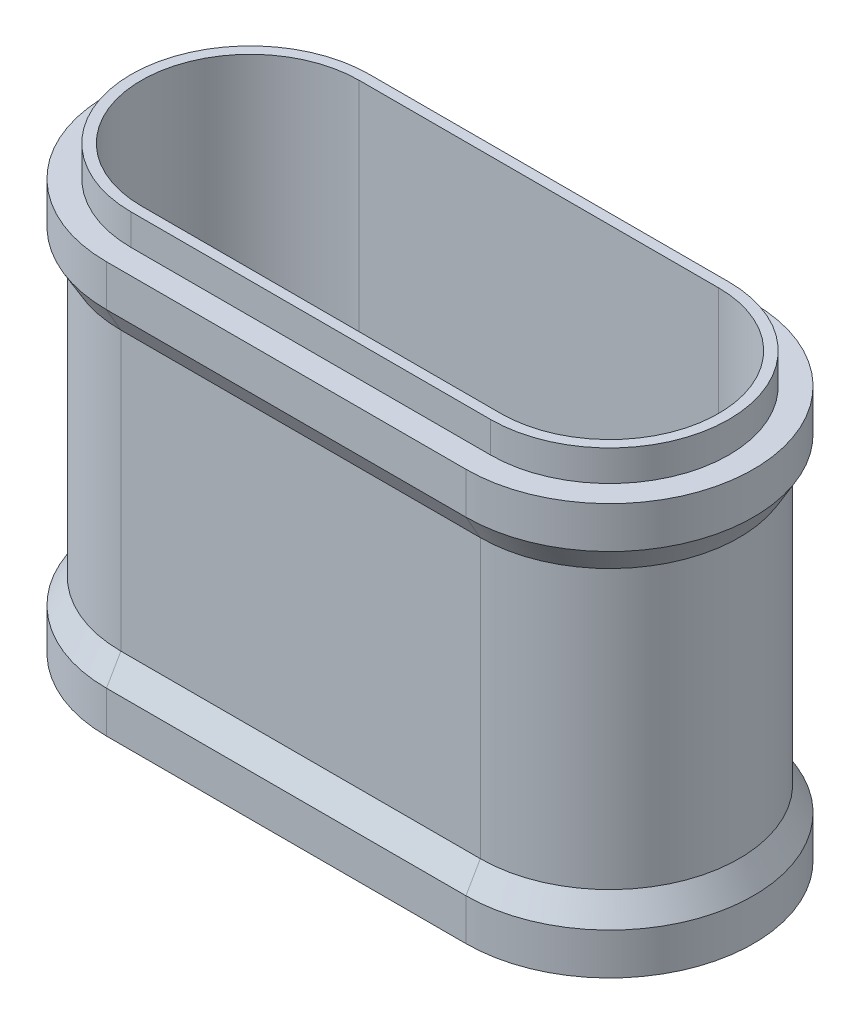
ISO-10303-21;
HEADER;
FILE_DESCRIPTION(('STEP AP214'),'2;1');
FILE_NAME('part.step','',(''),(''),'','','');
FILE_SCHEMA(('AUTOMOTIVE_DESIGN { 1 0 10303 214 1 1 1 1 }'));
ENDSEC;
DATA;
#1=APPLICATION_CONTEXT('core data for automotive mechanical design processes');
#2=APPLICATION_PROTOCOL_DEFINITION('international standard','automotive_design',2000,#1);
#3=PRODUCT_CONTEXT('',#1,'mechanical');
#4=PRODUCT('Part','Part','',(#3));
#5=PRODUCT_RELATED_PRODUCT_CATEGORY('part','',(#4));
#6=PRODUCT_DEFINITION_FORMATION('','',#4);
#7=PRODUCT_DEFINITION_CONTEXT('part definition',#1,'design');
#8=PRODUCT_DEFINITION('design','',#6,#7);
#9=PRODUCT_DEFINITION_SHAPE('','',#8);
#10=(LENGTH_UNIT() NAMED_UNIT(*) SI_UNIT(.MILLI.,.METRE.));
#11=(NAMED_UNIT(*) PLANE_ANGLE_UNIT() SI_UNIT($,.RADIAN.));
#12=(NAMED_UNIT(*) SI_UNIT($,.STERADIAN.) SOLID_ANGLE_UNIT());
#13=UNCERTAINTY_MEASURE_WITH_UNIT(LENGTH_MEASURE(1.E-05),#10,'distance_accuracy_value','');
#14=(GEOMETRIC_REPRESENTATION_CONTEXT(3) GLOBAL_UNCERTAINTY_ASSIGNED_CONTEXT((#13)) GLOBAL_UNIT_ASSIGNED_CONTEXT((#10,
#11,#12)) REPRESENTATION_CONTEXT('',''));
#15=CARTESIAN_POINT('',(0.,0.,0.));
#16=DIRECTION('',(0.,0.,1.));
#17=DIRECTION('',(1.,0.,0.));
#18=AXIS2_PLACEMENT_3D('',#15,#16,#17);
#19=CARTESIAN_POINT('',(-8.75,10.,0.));
#20=DIRECTION('',(0.,1.,0.));
#21=DIRECTION('',(0.,0.,1.));
#22=AXIS2_PLACEMENT_3D('',#19,#20,#21);
#23=PLANE('',#22);
#24=CARTESIAN_POINT('',(8.75,10.,0.));
#25=DIRECTION('',(0.,1.,0.));
#26=DIRECTION('',(0.,0.,1.));
#27=AXIS2_PLACEMENT_3D('',#24,#25,#26);
#28=CIRCLE('',#27,7.);
#29=CARTESIAN_POINT('',(8.75,10.,7.));
#30=VERTEX_POINT('',#29);
#31=CARTESIAN_POINT('',(8.75,10.,-7.));
#32=VERTEX_POINT('',#31);
#33=EDGE_CURVE('E280',#30,#32,#28,.T.);
#34=ORIENTED_EDGE('',*,*,#33,.T.);
#35=DIRECTION('',(-1.,0.,0.));
#36=VECTOR('',#35,1.);
#37=CARTESIAN_POINT('',(8.75,10.,-7.));
#38=LINE('',#37,#36);
#39=CARTESIAN_POINT('',(-8.75,10.,-7.));
#40=VERTEX_POINT('',#39);
#41=EDGE_CURVE('E295',#32,#40,#38,.T.);
#42=ORIENTED_EDGE('',*,*,#41,.T.);
#43=CARTESIAN_POINT('',(-8.75,10.,0.));
#44=DIRECTION('',(0.,1.,0.));
#45=DIRECTION('',(0.,0.,1.));
#46=AXIS2_PLACEMENT_3D('',#43,#44,#45);
#47=CIRCLE('',#46,7.);
#48=CARTESIAN_POINT('',(-8.75,10.,7.));
#49=VERTEX_POINT('',#48);
#50=EDGE_CURVE('E299',#40,#49,#47,.T.);
#51=ORIENTED_EDGE('',*,*,#50,.T.);
#52=DIRECTION('',(1.,0.,0.));
#53=VECTOR('',#52,1.);
#54=CARTESIAN_POINT('',(8.75,10.,7.));
#55=LINE('',#54,#53);
#56=EDGE_CURVE('E303',#49,#30,#55,.T.);
#57=ORIENTED_EDGE('',*,*,#56,.T.);
#58=EDGE_LOOP('',(#34,#42,#51,#57));
#59=FACE_BOUND('',#58,.T.);
#60=DIRECTION('',(1.,0.,0.));
#61=VECTOR('',#60,1.);
#62=CARTESIAN_POINT('',(-8.75,10.,5.8));
#63=LINE('',#62,#61);
#64=CARTESIAN_POINT('',(-8.75,10.,5.8));
#65=VERTEX_POINT('',#64);
#66=CARTESIAN_POINT('',(8.75,10.,5.8));
#67=VERTEX_POINT('',#66);
#68=EDGE_CURVE('E240',#65,#67,#63,.T.);
#69=ORIENTED_EDGE('',*,*,#68,.F.);
#70=CARTESIAN_POINT('',(-8.75,10.,0.));
#71=DIRECTION('',(0.,1.,0.));
#72=DIRECTION('',(0.,0.,1.));
#73=AXIS2_PLACEMENT_3D('',#70,#71,#72);
#74=CIRCLE('',#73,5.8);
#75=CARTESIAN_POINT('',(-8.75,10.,-5.8));
#76=VERTEX_POINT('',#75);
#77=EDGE_CURVE('E221',#76,#65,#74,.T.);
#78=ORIENTED_EDGE('',*,*,#77,.F.);
#79=DIRECTION('',(-1.,0.,0.));
#80=VECTOR('',#79,1.);
#81=CARTESIAN_POINT('',(8.74999999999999,10.,-5.8));
#82=LINE('',#81,#80);
#83=CARTESIAN_POINT('',(8.74999999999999,10.,-5.8));
#84=VERTEX_POINT('',#83);
#85=EDGE_CURVE('E227',#84,#76,#82,.T.);
#86=ORIENTED_EDGE('',*,*,#85,.F.);
#87=CARTESIAN_POINT('',(8.75,10.,0.));
#88=DIRECTION('',(0.,1.,0.));
#89=DIRECTION('',(0.,0.,1.));
#90=AXIS2_PLACEMENT_3D('',#87,#88,#89);
#91=CIRCLE('',#90,5.8);
#92=EDGE_CURVE('E243',#67,#84,#91,.T.);
#93=ORIENTED_EDGE('',*,*,#92,.F.);
#94=EDGE_LOOP('',(#69,#78,#86,#93));
#95=FACE_BOUND('',#94,.T.);
#96=ADVANCED_FACE('F45',(#59,#95),#23,.T.);
#97=CARTESIAN_POINT('',(-8.75,-10.,0.));
#98=DIRECTION('',(0.,1.,0.));
#99=DIRECTION('',(0.,0.,1.));
#100=AXIS2_PLACEMENT_3D('',#97,#98,#99);
#101=CYLINDRICAL_SURFACE('',#100,6.3);
#102=DIRECTION('',(0.,1.,0.));
#103=VECTOR('',#102,1.);
#104=CARTESIAN_POINT('',(-8.75,-10.,-6.3));
#105=LINE('',#104,#103);
#106=CARTESIAN_POINT('',(-8.75,-6.76794919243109,-6.3));
#107=VERTEX_POINT('',#106);
#108=CARTESIAN_POINT('',(-8.75,6.76794919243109,-6.3));
#109=VERTEX_POINT('',#108);
#110=EDGE_CURVE('E338',#107,#109,#105,.T.);
#111=ORIENTED_EDGE('',*,*,#110,.F.);
#112=CARTESIAN_POINT('',(-8.75,-6.76794919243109,0.));
#113=DIRECTION('',(0.,-1.,0.));
#114=DIRECTION('',(0.,0.,-1.));
#115=AXIS2_PLACEMENT_3D('',#112,#113,#114);
#116=CIRCLE('',#115,6.3);
#117=CARTESIAN_POINT('',(-8.75,-6.76794919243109,6.3));
#118=VERTEX_POINT('',#117);
#119=EDGE_CURVE('E376',#107,#118,#116,.F.);
#120=ORIENTED_EDGE('',*,*,#119,.T.);
#121=DIRECTION('',(0.,1.,0.));
#122=VECTOR('',#121,1.);
#123=CARTESIAN_POINT('',(-8.75,-10.,6.3));
#124=LINE('',#123,#122);
#125=CARTESIAN_POINT('',(-8.75,6.76794919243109,6.3));
#126=VERTEX_POINT('',#125);
#127=EDGE_CURVE('E332',#118,#126,#124,.T.);
#128=ORIENTED_EDGE('',*,*,#127,.T.);
#129=CARTESIAN_POINT('',(-8.75,6.76794919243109,0.));
#130=DIRECTION('',(0.,1.,0.));
#131=DIRECTION('',(0.,0.,1.));
#132=AXIS2_PLACEMENT_3D('',#129,#130,#131);
#133=CIRCLE('',#132,6.3);
#134=EDGE_CURVE('E373',#126,#109,#133,.F.);
#135=ORIENTED_EDGE('',*,*,#134,.T.);
#136=EDGE_LOOP('',(#111,#120,#128,#135));
#137=FACE_BOUND('',#136,.T.);
#138=ADVANCED_FACE('F477',(#137),#101,.T.);
#139=CARTESIAN_POINT('',(-8.75,-10.,-6.3));
#140=DIRECTION('',(0.,0.,-1.));
#141=DIRECTION('',(-1.,0.,0.));
#142=AXIS2_PLACEMENT_3D('',#139,#140,#141);
#143=PLANE('',#142);
#144=DIRECTION('',(0.,1.,0.));
#145=VECTOR('',#144,1.);
#146=CARTESIAN_POINT('',(8.75,-10.,-6.3));
#147=LINE('',#146,#145);
#148=CARTESIAN_POINT('',(8.75,-6.76794919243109,-6.3));
#149=VERTEX_POINT('',#148);
#150=CARTESIAN_POINT('',(8.75,6.76794919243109,-6.3));
#151=VERTEX_POINT('',#150);
#152=EDGE_CURVE('E343',#149,#151,#147,.T.);
#153=ORIENTED_EDGE('',*,*,#152,.F.);
#154=DIRECTION('',(-1.,0.,0.));
#155=VECTOR('',#154,1.);
#156=CARTESIAN_POINT('',(-8.75,-6.76794919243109,-6.3));
#157=LINE('',#156,#155);
#158=EDGE_CURVE('E364',#149,#107,#157,.T.);
#159=ORIENTED_EDGE('',*,*,#158,.T.);
#160=ORIENTED_EDGE('',*,*,#110,.T.);
#161=DIRECTION('',(1.,0.,0.));
#162=VECTOR('',#161,1.);
#163=CARTESIAN_POINT('',(-8.75,6.76794919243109,-6.3));
#164=LINE('',#163,#162);
#165=EDGE_CURVE('E360',#109,#151,#164,.T.);
#166=ORIENTED_EDGE('',*,*,#165,.T.);
#167=EDGE_LOOP('',(#153,#159,#160,#166));
#168=FACE_BOUND('',#167,.T.);
#169=ADVANCED_FACE('F458',(#168),#143,.T.);
#170=CARTESIAN_POINT('',(8.75,-10.,0.));
#171=DIRECTION('',(0.,1.,0.));
#172=DIRECTION('',(0.,0.,1.));
#173=AXIS2_PLACEMENT_3D('',#170,#171,#172);
#174=CYLINDRICAL_SURFACE('',#173,6.3);
#175=DIRECTION('',(0.,1.,0.));
#176=VECTOR('',#175,1.);
#177=CARTESIAN_POINT('',(8.75,-10.,6.29999999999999));
#178=LINE('',#177,#176);
#179=CARTESIAN_POINT('',(8.75,-6.76794919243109,6.29999999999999));
#180=VERTEX_POINT('',#179);
#181=CARTESIAN_POINT('',(8.75,6.76794919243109,6.29999999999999));
#182=VERTEX_POINT('',#181);
#183=EDGE_CURVE('E347',#180,#182,#178,.T.);
#184=ORIENTED_EDGE('',*,*,#183,.F.);
#185=CARTESIAN_POINT('',(8.75,-6.76794919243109,0.));
#186=DIRECTION('',(0.,-1.,0.));
#187=DIRECTION('',(0.,0.,-1.));
#188=AXIS2_PLACEMENT_3D('',#185,#186,#187);
#189=CIRCLE('',#188,6.3);
#190=EDGE_CURVE('E356',#180,#149,#189,.F.);
#191=ORIENTED_EDGE('',*,*,#190,.T.);
#192=ORIENTED_EDGE('',*,*,#152,.T.);
#193=CARTESIAN_POINT('',(8.75,6.76794919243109,0.));
#194=DIRECTION('',(0.,1.,0.));
#195=DIRECTION('',(0.,0.,1.));
#196=AXIS2_PLACEMENT_3D('',#193,#194,#195);
#197=CIRCLE('',#196,6.3);
#198=EDGE_CURVE('E342',#151,#182,#197,.F.);
#199=ORIENTED_EDGE('',*,*,#198,.T.);
#200=EDGE_LOOP('',(#184,#191,#192,#199));
#201=FACE_BOUND('',#200,.T.);
#202=ADVANCED_FACE('F462',(#201),#174,.T.);
#203=CARTESIAN_POINT('',(-8.75,-10.,6.3));
#204=DIRECTION('',(0.,0.,1.));
#205=DIRECTION('',(1.,0.,0.));
#206=AXIS2_PLACEMENT_3D('',#203,#204,#205);
#207=PLANE('',#206);
#208=ORIENTED_EDGE('',*,*,#127,.F.);
#209=DIRECTION('',(1.,0.,0.));
#210=VECTOR('',#209,1.);
#211=CARTESIAN_POINT('',(-8.75,-6.76794919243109,6.3));
#212=LINE('',#211,#210);
#213=EDGE_CURVE('E370',#118,#180,#212,.T.);
#214=ORIENTED_EDGE('',*,*,#213,.T.);
#215=ORIENTED_EDGE('',*,*,#183,.T.);
#216=DIRECTION('',(-1.,0.,0.));
#217=VECTOR('',#216,1.);
#218=CARTESIAN_POINT('',(-8.75,6.76794919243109,6.3));
#219=LINE('',#218,#217);
#220=EDGE_CURVE('E367',#182,#126,#219,.T.);
#221=ORIENTED_EDGE('',*,*,#220,.T.);
#222=EDGE_LOOP('',(#208,#214,#215,#221));
#223=FACE_BOUND('',#222,.T.);
#224=ADVANCED_FACE('F487',(#223),#207,.T.);
#225=CARTESIAN_POINT('',(-8.75,-10.,0.));
#226=DIRECTION('',(0.,1.,0.));
#227=DIRECTION('',(0.,0.,1.));
#228=AXIS2_PLACEMENT_3D('',#225,#226,#227);
#229=PLANE('',#228);
#230=DIRECTION('',(-1.,0.,0.));
#231=VECTOR('',#230,1.);
#232=CARTESIAN_POINT('',(-8.75,-10.,-5.3));
#233=LINE('',#232,#231);
#234=CARTESIAN_POINT('',(8.75,-10.,-5.3));
#235=VERTEX_POINT('',#234);
#236=CARTESIAN_POINT('',(-8.75,-10.,-5.3));
#237=VERTEX_POINT('',#236);
#238=EDGE_CURVE('E193',#235,#237,#233,.T.);
#239=ORIENTED_EDGE('',*,*,#238,.T.);
#240=CARTESIAN_POINT('',(-8.75,-10.,0.));
#241=DIRECTION('',(0.,1.,0.));
#242=DIRECTION('',(0.,0.,1.));
#243=AXIS2_PLACEMENT_3D('',#240,#241,#242);
#244=CIRCLE('',#243,5.3);
#245=CARTESIAN_POINT('',(-8.75,-10.,5.3));
#246=VERTEX_POINT('',#245);
#247=EDGE_CURVE('E310',#237,#246,#244,.T.);
#248=ORIENTED_EDGE('',*,*,#247,.T.);
#249=DIRECTION('',(1.,0.,0.));
#250=VECTOR('',#249,1.);
#251=CARTESIAN_POINT('',(-8.75,-10.,5.3));
#252=LINE('',#251,#250);
#253=CARTESIAN_POINT('',(8.75,-10.,5.3));
#254=VERTEX_POINT('',#253);
#255=EDGE_CURVE('E321',#246,#254,#252,.T.);
#256=ORIENTED_EDGE('',*,*,#255,.T.);
#257=CARTESIAN_POINT('',(8.75,-10.,0.));
#258=DIRECTION('',(0.,1.,0.));
#259=DIRECTION('',(0.,0.,1.));
#260=AXIS2_PLACEMENT_3D('',#257,#258,#259);
#261=CIRCLE('',#260,5.3);
#262=EDGE_CURVE('E325',#254,#235,#261,.T.);
#263=ORIENTED_EDGE('',*,*,#262,.T.);
#264=EDGE_LOOP('',(#239,#248,#256,#263));
#265=FACE_BOUND('',#264,.T.);
#266=CARTESIAN_POINT('',(8.75,-10.,0.));
#267=DIRECTION('',(0.,1.,0.));
#268=DIRECTION('',(0.,0.,1.));
#269=AXIS2_PLACEMENT_3D('',#266,#267,#268);
#270=CIRCLE('',#269,7.);
#271=CARTESIAN_POINT('',(8.75,-10.,7.));
#272=VERTEX_POINT('',#271);
#273=CARTESIAN_POINT('',(8.75,-10.,-7.));
#274=VERTEX_POINT('',#273);
#275=EDGE_CURVE('E262',#272,#274,#270,.T.);
#276=ORIENTED_EDGE('',*,*,#275,.F.);
#277=DIRECTION('',(1.,0.,0.));
#278=VECTOR('',#277,1.);
#279=CARTESIAN_POINT('',(8.75,-10.,7.));
#280=LINE('',#279,#278);
#281=CARTESIAN_POINT('',(-8.75,-10.,7.));
#282=VERTEX_POINT('',#281);
#283=EDGE_CURVE('E266',#282,#272,#280,.T.);
#284=ORIENTED_EDGE('',*,*,#283,.F.);
#285=CARTESIAN_POINT('',(-8.75,-10.,0.));
#286=DIRECTION('',(0.,1.,0.));
#287=DIRECTION('',(0.,0.,1.));
#288=AXIS2_PLACEMENT_3D('',#285,#286,#287);
#289=CIRCLE('',#288,7.);
#290=CARTESIAN_POINT('',(-8.75,-10.,-7.));
#291=VERTEX_POINT('',#290);
#292=EDGE_CURVE('E269',#291,#282,#289,.T.);
#293=ORIENTED_EDGE('',*,*,#292,.F.);
#294=DIRECTION('',(-1.,0.,0.));
#295=VECTOR('',#294,1.);
#296=CARTESIAN_POINT('',(8.75,-10.,-7.));
#297=LINE('',#296,#295);
#298=EDGE_CURVE('E272',#274,#291,#297,.T.);
#299=ORIENTED_EDGE('',*,*,#298,.F.);
#300=EDGE_LOOP('',(#276,#284,#293,#299));
#301=FACE_BOUND('',#300,.T.);
#302=ADVANCED_FACE('F489',(#265,#301),#229,.F.);
#303=CARTESIAN_POINT('',(-8.75,-10.,0.));
#304=DIRECTION('',(0.,1.,0.));
#305=DIRECTION('',(0.,0.,1.));
#306=AXIS2_PLACEMENT_3D('',#303,#304,#305);
#307=CYLINDRICAL_SURFACE('',#306,5.3);
#308=DIRECTION('',(0.,1.,0.));
#309=VECTOR('',#308,1.);
#310=CARTESIAN_POINT('',(-8.75,-10.,-5.3));
#311=LINE('',#310,#309);
#312=CARTESIAN_POINT('',(-8.75,11.5,-5.3));
#313=VERTEX_POINT('',#312);
#314=EDGE_CURVE('E197',#237,#313,#311,.T.);
#315=ORIENTED_EDGE('',*,*,#314,.T.);
#316=CARTESIAN_POINT('',(-8.75,11.5,0.));
#317=DIRECTION('',(0.,1.,0.));
#318=DIRECTION('',(0.,0.,1.));
#319=AXIS2_PLACEMENT_3D('',#316,#317,#318);
#320=CIRCLE('',#319,5.3);
#321=CARTESIAN_POINT('',(-8.75,11.5,5.3));
#322=VERTEX_POINT('',#321);
#323=EDGE_CURVE('E212',#313,#322,#320,.T.);
#324=ORIENTED_EDGE('',*,*,#323,.T.);
#325=DIRECTION('',(0.,1.,0.));
#326=VECTOR('',#325,1.);
#327=CARTESIAN_POINT('',(-8.75,-10.,5.3));
#328=LINE('',#327,#326);
#329=EDGE_CURVE('E330',#246,#322,#328,.T.);
#330=ORIENTED_EDGE('',*,*,#329,.F.);
#331=ORIENTED_EDGE('',*,*,#247,.F.);
#332=EDGE_LOOP('',(#315,#324,#330,#331));
#333=FACE_BOUND('',#332,.T.);
#334=ADVANCED_FACE('F495',(#333),#307,.F.);
#335=CARTESIAN_POINT('',(-8.75,-10.,-5.3));
#336=DIRECTION('',(0.,0.,-1.));
#337=DIRECTION('',(-1.,0.,0.));
#338=AXIS2_PLACEMENT_3D('',#335,#336,#337);
#339=PLANE('',#338);
#340=DIRECTION('',(0.,1.,0.));
#341=VECTOR('',#340,1.);
#342=CARTESIAN_POINT('',(8.75,-10.,-5.3));
#343=LINE('',#342,#341);
#344=CARTESIAN_POINT('',(8.74999999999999,11.5,-5.3));
#345=VERTEX_POINT('',#344);
#346=EDGE_CURVE('E186',#235,#345,#343,.T.);
#347=ORIENTED_EDGE('',*,*,#346,.T.);
#348=DIRECTION('',(-1.,0.,0.));
#349=VECTOR('',#348,1.);
#350=CARTESIAN_POINT('',(8.74999999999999,11.5,-5.3));
#351=LINE('',#350,#349);
#352=EDGE_CURVE('E190',#345,#313,#351,.T.);
#353=ORIENTED_EDGE('',*,*,#352,.T.);
#354=ORIENTED_EDGE('',*,*,#314,.F.);
#355=ORIENTED_EDGE('',*,*,#238,.F.);
#356=EDGE_LOOP('',(#347,#353,#354,#355));
#357=FACE_BOUND('',#356,.T.);
#358=ADVANCED_FACE('F188',(#357),#339,.F.);
#359=CARTESIAN_POINT('',(8.75,-10.,0.));
#360=DIRECTION('',(0.,1.,0.));
#361=DIRECTION('',(0.,0.,1.));
#362=AXIS2_PLACEMENT_3D('',#359,#360,#361);
#363=CYLINDRICAL_SURFACE('',#362,5.3);
#364=DIRECTION('',(0.,1.,0.));
#365=VECTOR('',#364,1.);
#366=CARTESIAN_POINT('',(8.75,-10.,5.3));
#367=LINE('',#366,#365);
#368=CARTESIAN_POINT('',(8.75,11.5,5.3));
#369=VERTEX_POINT('',#368);
#370=EDGE_CURVE('E198',#254,#369,#367,.T.);
#371=ORIENTED_EDGE('',*,*,#370,.T.);
#372=CARTESIAN_POINT('',(8.75,11.5,0.));
#373=DIRECTION('',(0.,1.,0.));
#374=DIRECTION('',(0.,0.,1.));
#375=AXIS2_PLACEMENT_3D('',#372,#373,#374);
#376=CIRCLE('',#375,5.3);
#377=EDGE_CURVE('E201',#369,#345,#376,.T.);
#378=ORIENTED_EDGE('',*,*,#377,.T.);
#379=ORIENTED_EDGE('',*,*,#346,.F.);
#380=ORIENTED_EDGE('',*,*,#262,.F.);
#381=EDGE_LOOP('',(#371,#378,#379,#380));
#382=FACE_BOUND('',#381,.T.);
#383=ADVANCED_FACE('F202',(#382),#363,.F.);
#384=CARTESIAN_POINT('',(-8.75,-10.,5.3));
#385=DIRECTION('',(0.,0.,1.));
#386=DIRECTION('',(1.,0.,0.));
#387=AXIS2_PLACEMENT_3D('',#384,#385,#386);
#388=PLANE('',#387);
#389=ORIENTED_EDGE('',*,*,#329,.T.);
#390=DIRECTION('',(1.,0.,0.));
#391=VECTOR('',#390,1.);
#392=CARTESIAN_POINT('',(-8.75,11.5,5.3));
#393=LINE('',#392,#391);
#394=EDGE_CURVE('E216',#322,#369,#393,.T.);
#395=ORIENTED_EDGE('',*,*,#394,.T.);
#396=ORIENTED_EDGE('',*,*,#370,.F.);
#397=ORIENTED_EDGE('',*,*,#255,.F.);
#398=EDGE_LOOP('',(#389,#395,#396,#397));
#399=FACE_BOUND('',#398,.T.);
#400=ADVANCED_FACE('F512',(#399),#388,.F.);
#401=CARTESIAN_POINT('',(8.75,8.5,0.));
#402=DIRECTION('',(0.,1.,0.));
#403=DIRECTION('',(0.,0.,1.));
#404=AXIS2_PLACEMENT_3D('',#401,#402,#403);
#405=CYLINDRICAL_SURFACE('',#404,7.);
#406=ORIENTED_EDGE('',*,*,#33,.F.);
#407=DIRECTION('',(0.,1.,0.));
#408=VECTOR('',#407,1.);
#409=CARTESIAN_POINT('',(8.75,8.5,7.));
#410=LINE('',#409,#408);
#411=CARTESIAN_POINT('',(8.75,7.98038475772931,6.99999999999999));
#412=VERTEX_POINT('',#411);
#413=EDGE_CURVE('E64',#412,#30,#410,.T.);
#414=ORIENTED_EDGE('',*,*,#413,.F.);
#415=CARTESIAN_POINT('',(8.75,7.98038475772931,0.));
#416=DIRECTION('',(0.,1.,0.));
#417=DIRECTION('',(0.,0.,1.));
#418=AXIS2_PLACEMENT_3D('',#415,#416,#417);
#419=CIRCLE('',#418,7.);
#420=CARTESIAN_POINT('',(8.75,7.98038475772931,-7.));
#421=VERTEX_POINT('',#420);
#422=EDGE_CURVE('E399',#412,#421,#419,.T.);
#423=ORIENTED_EDGE('',*,*,#422,.T.);
#424=DIRECTION('',(0.,1.,0.));
#425=VECTOR('',#424,1.);
#426=CARTESIAN_POINT('',(8.75,8.5,-7.));
#427=LINE('',#426,#425);
#428=EDGE_CURVE('E307',#421,#32,#427,.T.);
#429=ORIENTED_EDGE('',*,*,#428,.T.);
#430=EDGE_LOOP('',(#406,#414,#423,#429));
#431=FACE_BOUND('',#430,.T.);
#432=ADVANCED_FACE('F443',(#431),#405,.T.);
#433=CARTESIAN_POINT('',(8.75,8.5,7.));
#434=DIRECTION('',(0.,0.,1.));
#435=DIRECTION('',(1.,0.,0.));
#436=AXIS2_PLACEMENT_3D('',#433,#434,#435);
#437=PLANE('',#436);
#438=ORIENTED_EDGE('',*,*,#56,.F.);
#439=DIRECTION('',(0.,1.,0.));
#440=VECTOR('',#439,1.);
#441=CARTESIAN_POINT('',(-8.75,8.5,7.));
#442=LINE('',#441,#440);
#443=CARTESIAN_POINT('',(-8.75,7.98038475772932,7.));
#444=VERTEX_POINT('',#443);
#445=EDGE_CURVE('E70',#444,#49,#442,.T.);
#446=ORIENTED_EDGE('',*,*,#445,.F.);
#447=DIRECTION('',(1.,0.,0.));
#448=VECTOR('',#447,1.);
#449=CARTESIAN_POINT('',(-8.75,7.98038475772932,7.));
#450=LINE('',#449,#448);
#451=EDGE_CURVE('E11',#444,#412,#450,.T.);
#452=ORIENTED_EDGE('',*,*,#451,.T.);
#453=ORIENTED_EDGE('',*,*,#413,.T.);
#454=EDGE_LOOP('',(#438,#446,#452,#453));
#455=FACE_BOUND('',#454,.T.);
#456=ADVANCED_FACE('F442',(#455),#437,.T.);
#457=CARTESIAN_POINT('',(-8.75,8.5,0.));
#458=DIRECTION('',(0.,1.,0.));
#459=DIRECTION('',(0.,0.,1.));
#460=AXIS2_PLACEMENT_3D('',#457,#458,#459);
#461=CYLINDRICAL_SURFACE('',#460,7.);
#462=ORIENTED_EDGE('',*,*,#50,.F.);
#463=DIRECTION('',(0.,1.,0.));
#464=VECTOR('',#463,1.);
#465=CARTESIAN_POINT('',(-8.75,8.5,-7.));
#466=LINE('',#465,#464);
#467=CARTESIAN_POINT('',(-8.75,7.98038475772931,-7.));
#468=VERTEX_POINT('',#467);
#469=EDGE_CURVE('E313',#468,#40,#466,.T.);
#470=ORIENTED_EDGE('',*,*,#469,.F.);
#471=CARTESIAN_POINT('',(-8.75,7.98038475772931,0.));
#472=DIRECTION('',(0.,1.,0.));
#473=DIRECTION('',(0.,0.,1.));
#474=AXIS2_PLACEMENT_3D('',#471,#472,#473);
#475=CIRCLE('',#474,7.);
#476=EDGE_CURVE('E56',#468,#444,#475,.T.);
#477=ORIENTED_EDGE('',*,*,#476,.T.);
#478=ORIENTED_EDGE('',*,*,#445,.T.);
#479=EDGE_LOOP('',(#462,#470,#477,#478));
#480=FACE_BOUND('',#479,.T.);
#481=ADVANCED_FACE('F449',(#480),#461,.T.);
#482=CARTESIAN_POINT('',(8.75,8.5,-7.));
#483=DIRECTION('',(0.,0.,-1.));
#484=DIRECTION('',(-1.,0.,0.));
#485=AXIS2_PLACEMENT_3D('',#482,#483,#484);
#486=PLANE('',#485);
#487=ORIENTED_EDGE('',*,*,#428,.F.);
#488=DIRECTION('',(-1.,0.,0.));
#489=VECTOR('',#488,1.);
#490=CARTESIAN_POINT('',(-8.75,7.98038475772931,-7.));
#491=LINE('',#490,#489);
#492=EDGE_CURVE('E395',#421,#468,#491,.T.);
#493=ORIENTED_EDGE('',*,*,#492,.T.);
#494=ORIENTED_EDGE('',*,*,#469,.T.);
#495=ORIENTED_EDGE('',*,*,#41,.F.);
#496=EDGE_LOOP('',(#487,#493,#494,#495));
#497=FACE_BOUND('',#496,.T.);
#498=ADVANCED_FACE('F562',(#497),#486,.T.);
#499=CARTESIAN_POINT('',(8.75,-8.5,0.));
#500=DIRECTION('',(0.,-1.,0.));
#501=DIRECTION('',(0.,0.,-1.));
#502=AXIS2_PLACEMENT_3D('',#499,#500,#501);
#503=CYLINDRICAL_SURFACE('',#502,7.);
#504=ORIENTED_EDGE('',*,*,#275,.T.);
#505=DIRECTION('',(0.,-1.,0.));
#506=VECTOR('',#505,1.);
#507=CARTESIAN_POINT('',(8.75,-8.5,-7.));
#508=LINE('',#507,#506);
#509=CARTESIAN_POINT('',(8.74999999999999,-7.98038475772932,-7.00000000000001));
#510=VERTEX_POINT('',#509);
#511=EDGE_CURVE('E276',#510,#274,#508,.T.);
#512=ORIENTED_EDGE('',*,*,#511,.F.);
#513=CARTESIAN_POINT('',(8.75,-7.98038475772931,0.));
#514=DIRECTION('',(0.,-1.,0.));
#515=DIRECTION('',(0.,0.,-1.));
#516=AXIS2_PLACEMENT_3D('',#513,#514,#515);
#517=CIRCLE('',#516,7.);
#518=CARTESIAN_POINT('',(8.75,-7.98038475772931,7.));
#519=VERTEX_POINT('',#518);
#520=EDGE_CURVE('E379',#510,#519,#517,.T.);
#521=ORIENTED_EDGE('',*,*,#520,.T.);
#522=DIRECTION('',(0.,-1.,0.));
#523=VECTOR('',#522,1.);
#524=CARTESIAN_POINT('',(8.75,-8.5,7.));
#525=LINE('',#524,#523);
#526=EDGE_CURVE('E275',#519,#272,#525,.T.);
#527=ORIENTED_EDGE('',*,*,#526,.T.);
#528=EDGE_LOOP('',(#504,#512,#521,#527));
#529=FACE_BOUND('',#528,.T.);
#530=ADVANCED_FACE('F571',(#529),#503,.T.);
#531=CARTESIAN_POINT('',(8.75,-8.5,-7.));
#532=DIRECTION('',(0.,0.,1.));
#533=DIRECTION('',(1.,0.,0.));
#534=AXIS2_PLACEMENT_3D('',#531,#532,#533);
#535=PLANE('',#534);
#536=ORIENTED_EDGE('',*,*,#298,.T.);
#537=DIRECTION('',(0.,-1.,0.));
#538=VECTOR('',#537,1.);
#539=CARTESIAN_POINT('',(-8.75,-8.5,-7.));
#540=LINE('',#539,#538);
#541=CARTESIAN_POINT('',(-8.75,-7.98038475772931,-7.));
#542=VERTEX_POINT('',#541);
#543=EDGE_CURVE('E281',#542,#291,#540,.T.);
#544=ORIENTED_EDGE('',*,*,#543,.F.);
#545=DIRECTION('',(1.,0.,0.));
#546=VECTOR('',#545,1.);
#547=CARTESIAN_POINT('',(8.75,-7.98038475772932,-7.));
#548=LINE('',#547,#546);
#549=EDGE_CURVE('E383',#542,#510,#548,.T.);
#550=ORIENTED_EDGE('',*,*,#549,.T.);
#551=ORIENTED_EDGE('',*,*,#511,.T.);
#552=EDGE_LOOP('',(#536,#544,#550,#551));
#553=FACE_BOUND('',#552,.T.);
#554=ADVANCED_FACE('F580',(#553),#535,.F.);
#555=CARTESIAN_POINT('',(-8.75,-8.5,0.));
#556=DIRECTION('',(0.,-1.,0.));
#557=DIRECTION('',(0.,0.,-1.));
#558=AXIS2_PLACEMENT_3D('',#555,#556,#557);
#559=CYLINDRICAL_SURFACE('',#558,7.);
#560=ORIENTED_EDGE('',*,*,#292,.T.);
#561=DIRECTION('',(0.,-1.,0.));
#562=VECTOR('',#561,1.);
#563=CARTESIAN_POINT('',(-8.75,-8.5,7.));
#564=LINE('',#563,#562);
#565=CARTESIAN_POINT('',(-8.75,-7.98038475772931,7.));
#566=VERTEX_POINT('',#565);
#567=EDGE_CURVE('E285',#566,#282,#564,.T.);
#568=ORIENTED_EDGE('',*,*,#567,.F.);
#569=CARTESIAN_POINT('',(-8.75,-7.98038475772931,0.));
#570=DIRECTION('',(0.,-1.,0.));
#571=DIRECTION('',(0.,0.,-1.));
#572=AXIS2_PLACEMENT_3D('',#569,#570,#571);
#573=CIRCLE('',#572,7.);
#574=EDGE_CURVE('E391',#566,#542,#573,.T.);
#575=ORIENTED_EDGE('',*,*,#574,.T.);
#576=ORIENTED_EDGE('',*,*,#543,.T.);
#577=EDGE_LOOP('',(#560,#568,#575,#576));
#578=FACE_BOUND('',#577,.T.);
#579=ADVANCED_FACE('F592',(#578),#559,.T.);
#580=CARTESIAN_POINT('',(8.75,-8.5,7.));
#581=DIRECTION('',(0.,0.,-1.));
#582=DIRECTION('',(-1.,0.,0.));
#583=AXIS2_PLACEMENT_3D('',#580,#581,#582);
#584=PLANE('',#583);
#585=ORIENTED_EDGE('',*,*,#283,.T.);
#586=ORIENTED_EDGE('',*,*,#526,.F.);
#587=DIRECTION('',(-1.,0.,0.));
#588=VECTOR('',#587,1.);
#589=CARTESIAN_POINT('',(8.75,-7.98038475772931,7.));
#590=LINE('',#589,#588);
#591=EDGE_CURVE('E387',#519,#566,#590,.T.);
#592=ORIENTED_EDGE('',*,*,#591,.T.);
#593=ORIENTED_EDGE('',*,*,#567,.T.);
#594=EDGE_LOOP('',(#585,#586,#592,#593));
#595=FACE_BOUND('',#594,.T.);
#596=ADVANCED_FACE('F603',(#595),#584,.F.);
#597=CARTESIAN_POINT('',(-8.75,11.5,0.));
#598=DIRECTION('',(0.,1.,0.));
#599=DIRECTION('',(0.,0.,1.));
#600=AXIS2_PLACEMENT_3D('',#597,#598,#599);
#601=PLANE('',#600);
#602=CARTESIAN_POINT('',(-8.75,11.5,0.));
#603=DIRECTION('',(0.,1.,0.));
#604=DIRECTION('',(0.,0.,1.));
#605=AXIS2_PLACEMENT_3D('',#602,#603,#604);
#606=CIRCLE('',#605,5.8);
#607=CARTESIAN_POINT('',(-8.75,11.5,-5.8));
#608=VERTEX_POINT('',#607);
#609=CARTESIAN_POINT('',(-8.75,11.5,5.8));
#610=VERTEX_POINT('',#609);
#611=EDGE_CURVE('E222',#608,#610,#606,.T.);
#612=ORIENTED_EDGE('',*,*,#611,.T.);
#613=DIRECTION('',(1.,0.,0.));
#614=VECTOR('',#613,1.);
#615=CARTESIAN_POINT('',(-8.75,11.5,5.8));
#616=LINE('',#615,#614);
#617=CARTESIAN_POINT('',(8.75,11.5,5.8));
#618=VERTEX_POINT('',#617);
#619=EDGE_CURVE('E226',#610,#618,#616,.T.);
#620=ORIENTED_EDGE('',*,*,#619,.T.);
#621=CARTESIAN_POINT('',(8.75,11.5,0.));
#622=DIRECTION('',(0.,1.,0.));
#623=DIRECTION('',(0.,0.,1.));
#624=AXIS2_PLACEMENT_3D('',#621,#622,#623);
#625=CIRCLE('',#624,5.8);
#626=CARTESIAN_POINT('',(8.75,11.5,-5.8));
#627=VERTEX_POINT('',#626);
#628=EDGE_CURVE('E230',#618,#627,#625,.T.);
#629=ORIENTED_EDGE('',*,*,#628,.T.);
#630=DIRECTION('',(-1.,0.,0.));
#631=VECTOR('',#630,1.);
#632=CARTESIAN_POINT('',(8.74999999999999,11.5,-5.8));
#633=LINE('',#632,#631);
#634=EDGE_CURVE('E233',#627,#608,#633,.T.);
#635=ORIENTED_EDGE('',*,*,#634,.T.);
#636=EDGE_LOOP('',(#612,#620,#629,#635));
#637=FACE_BOUND('',#636,.T.);
#638=ORIENTED_EDGE('',*,*,#352,.F.);
#639=ORIENTED_EDGE('',*,*,#377,.F.);
#640=ORIENTED_EDGE('',*,*,#394,.F.);
#641=ORIENTED_EDGE('',*,*,#323,.F.);
#642=EDGE_LOOP('',(#638,#639,#640,#641));
#643=FACE_BOUND('',#642,.T.);
#644=ADVANCED_FACE('F210',(#637,#643),#601,.T.);
#645=CARTESIAN_POINT('',(-8.75,11.5,0.));
#646=DIRECTION('',(0.,-1.,0.));
#647=DIRECTION('',(0.,0.,-1.));
#648=AXIS2_PLACEMENT_3D('',#645,#646,#647);
#649=CYLINDRICAL_SURFACE('',#648,5.8);
#650=ORIENTED_EDGE('',*,*,#77,.T.);
#651=DIRECTION('',(0.,-1.,0.));
#652=VECTOR('',#651,1.);
#653=CARTESIAN_POINT('',(-8.75,11.5,5.8));
#654=LINE('',#653,#652);
#655=EDGE_CURVE('E259',#610,#65,#654,.T.);
#656=ORIENTED_EDGE('',*,*,#655,.F.);
#657=ORIENTED_EDGE('',*,*,#611,.F.);
#658=DIRECTION('',(0.,-1.,0.));
#659=VECTOR('',#658,1.);
#660=CARTESIAN_POINT('',(-8.75,11.5,-5.8));
#661=LINE('',#660,#659);
#662=EDGE_CURVE('E236',#608,#76,#661,.T.);
#663=ORIENTED_EDGE('',*,*,#662,.T.);
#664=EDGE_LOOP('',(#650,#656,#657,#663));
#665=FACE_BOUND('',#664,.T.);
#666=ADVANCED_FACE('F726',(#665),#649,.T.);
#667=CARTESIAN_POINT('',(-8.75,11.5,5.8));
#668=DIRECTION('',(0.,0.,-1.));
#669=DIRECTION('',(-1.,0.,0.));
#670=AXIS2_PLACEMENT_3D('',#667,#668,#669);
#671=PLANE('',#670);
#672=ORIENTED_EDGE('',*,*,#68,.T.);
#673=DIRECTION('',(0.,-1.,0.));
#674=VECTOR('',#673,1.);
#675=CARTESIAN_POINT('',(8.75,11.5,5.8));
#676=LINE('',#675,#674);
#677=EDGE_CURVE('E255',#618,#67,#676,.T.);
#678=ORIENTED_EDGE('',*,*,#677,.F.);
#679=ORIENTED_EDGE('',*,*,#619,.F.);
#680=ORIENTED_EDGE('',*,*,#655,.T.);
#681=EDGE_LOOP('',(#672,#678,#679,#680));
#682=FACE_BOUND('',#681,.T.);
#683=ADVANCED_FACE('F716',(#682),#671,.F.);
#684=CARTESIAN_POINT('',(8.75,11.5,0.));
#685=DIRECTION('',(0.,-1.,0.));
#686=DIRECTION('',(0.,0.,-1.));
#687=AXIS2_PLACEMENT_3D('',#684,#685,#686);
#688=CYLINDRICAL_SURFACE('',#687,5.8);
#689=ORIENTED_EDGE('',*,*,#92,.T.);
#690=DIRECTION('',(0.,-1.,0.));
#691=VECTOR('',#690,1.);
#692=CARTESIAN_POINT('',(8.75,11.5,-5.8));
#693=LINE('',#692,#691);
#694=EDGE_CURVE('E252',#627,#84,#693,.T.);
#695=ORIENTED_EDGE('',*,*,#694,.F.);
#696=ORIENTED_EDGE('',*,*,#628,.F.);
#697=ORIENTED_EDGE('',*,*,#677,.T.);
#698=EDGE_LOOP('',(#689,#695,#696,#697));
#699=FACE_BOUND('',#698,.T.);
#700=ADVANCED_FACE('F706',(#699),#688,.T.);
#701=CARTESIAN_POINT('',(8.74999999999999,11.5,-5.8));
#702=DIRECTION('',(0.,0.,1.));
#703=DIRECTION('',(1.,0.,0.));
#704=AXIS2_PLACEMENT_3D('',#701,#702,#703);
#705=PLANE('',#704);
#706=ORIENTED_EDGE('',*,*,#85,.T.);
#707=ORIENTED_EDGE('',*,*,#662,.F.);
#708=ORIENTED_EDGE('',*,*,#634,.F.);
#709=ORIENTED_EDGE('',*,*,#694,.T.);
#710=EDGE_LOOP('',(#706,#707,#708,#709));
#711=FACE_BOUND('',#710,.T.);
#712=ADVANCED_FACE('F626',(#711),#705,.F.);
#713=CARTESIAN_POINT('',(-8.75,-6.76794919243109,0.));
#714=DIRECTION('',(0.,-1.,0.));
#715=DIRECTION('',(0.,0.,-1.));
#716=AXIS2_PLACEMENT_3D('',#713,#714,#715);
#717=CONICAL_SURFACE('',#716,6.3,0.523598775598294);
#718=DIRECTION('',(0.,0.866025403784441,0.499999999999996));
#719=VECTOR('',#718,1.);
#720=CARTESIAN_POINT('',(-8.75,-8.5,-7.30000000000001));
#721=LINE('',#720,#719);
#722=EDGE_CURVE('E411',#542,#107,#721,.T.);
#723=ORIENTED_EDGE('',*,*,#722,.F.);
#724=ORIENTED_EDGE('',*,*,#574,.F.);
#725=DIRECTION('',(0.,-0.866025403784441,0.499999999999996));
#726=VECTOR('',#725,1.);
#727=CARTESIAN_POINT('',(-8.75,-6.76794919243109,6.3));
#728=LINE('',#727,#726);
#729=EDGE_CURVE('E208',#118,#566,#728,.T.);
#730=ORIENTED_EDGE('',*,*,#729,.F.);
#731=ORIENTED_EDGE('',*,*,#119,.F.);
#732=EDGE_LOOP('',(#723,#724,#730,#731));
#733=FACE_BOUND('',#732,.T.);
#734=ADVANCED_FACE('F481',(#733),#717,.T.);
#735=CARTESIAN_POINT('',(-8.75,-6.76794919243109,6.3));
#736=DIRECTION('',(0.,-0.499999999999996,-0.866025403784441));
#737=DIRECTION('',(1.,0.,0.));
#738=AXIS2_PLACEMENT_3D('',#735,#736,#737);
#739=PLANE('',#738);
#740=ORIENTED_EDGE('',*,*,#729,.T.);
#741=ORIENTED_EDGE('',*,*,#591,.F.);
#742=DIRECTION('',(0.,-0.866025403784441,0.499999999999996));
#743=VECTOR('',#742,1.);
#744=CARTESIAN_POINT('',(8.75,-6.76794919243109,6.3));
#745=LINE('',#744,#743);
#746=EDGE_CURVE('E407',#180,#519,#745,.T.);
#747=ORIENTED_EDGE('',*,*,#746,.F.);
#748=ORIENTED_EDGE('',*,*,#213,.F.);
#749=EDGE_LOOP('',(#740,#741,#747,#748));
#750=FACE_BOUND('',#749,.T.);
#751=ADVANCED_FACE('F485',(#750),#739,.F.);
#752=CARTESIAN_POINT('',(-8.75,-6.76794919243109,-6.3));
#753=DIRECTION('',(0.,-0.499999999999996,0.866025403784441));
#754=DIRECTION('',(-1.,0.,0.));
#755=AXIS2_PLACEMENT_3D('',#752,#753,#754);
#756=PLANE('',#755);
#757=ORIENTED_EDGE('',*,*,#722,.T.);
#758=ORIENTED_EDGE('',*,*,#158,.F.);
#759=DIRECTION('',(0.,0.866025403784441,0.499999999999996));
#760=VECTOR('',#759,1.);
#761=CARTESIAN_POINT('',(8.75,-8.5,-7.30000000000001));
#762=LINE('',#761,#760);
#763=EDGE_CURVE('E404',#510,#149,#762,.T.);
#764=ORIENTED_EDGE('',*,*,#763,.F.);
#765=ORIENTED_EDGE('',*,*,#549,.F.);
#766=EDGE_LOOP('',(#757,#758,#764,#765));
#767=FACE_BOUND('',#766,.T.);
#768=ADVANCED_FACE('F473',(#767),#756,.F.);
#769=CARTESIAN_POINT('',(8.75,-6.76794919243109,0.));
#770=DIRECTION('',(0.,-1.,0.));
#771=DIRECTION('',(0.,0.,-1.));
#772=AXIS2_PLACEMENT_3D('',#769,#770,#771);
#773=CONICAL_SURFACE('',#772,6.3,0.523598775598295);
#774=ORIENTED_EDGE('',*,*,#746,.T.);
#775=ORIENTED_EDGE('',*,*,#520,.F.);
#776=ORIENTED_EDGE('',*,*,#763,.T.);
#777=ORIENTED_EDGE('',*,*,#190,.F.);
#778=EDGE_LOOP('',(#774,#775,#776,#777));
#779=FACE_BOUND('',#778,.T.);
#780=ADVANCED_FACE('F466',(#779),#773,.T.);
#781=CARTESIAN_POINT('',(-8.75,6.76794919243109,6.3));
#782=DIRECTION('',(0.,0.499999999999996,-0.866025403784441));
#783=DIRECTION('',(-1.,0.,0.));
#784=AXIS2_PLACEMENT_3D('',#781,#782,#783);
#785=PLANE('',#784);
#786=DIRECTION('',(0.,-0.866025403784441,-0.499999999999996));
#787=VECTOR('',#786,1.);
#788=CARTESIAN_POINT('',(8.75,8.5,7.30000000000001));
#789=LINE('',#788,#787);
#790=EDGE_CURVE('E424',#412,#182,#789,.T.);
#791=ORIENTED_EDGE('',*,*,#790,.F.);
#792=ORIENTED_EDGE('',*,*,#451,.F.);
#793=DIRECTION('',(0.,0.866025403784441,0.499999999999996));
#794=VECTOR('',#793,1.);
#795=CARTESIAN_POINT('',(-8.75,6.76794919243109,6.3));
#796=LINE('',#795,#794);
#797=EDGE_CURVE('E50',#126,#444,#796,.T.);
#798=ORIENTED_EDGE('',*,*,#797,.F.);
#799=ORIENTED_EDGE('',*,*,#220,.F.);
#800=EDGE_LOOP('',(#791,#792,#798,#799));
#801=FACE_BOUND('',#800,.T.);
#802=ADVANCED_FACE('F48',(#801),#785,.F.);
#803=CARTESIAN_POINT('',(-8.75,6.76794919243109,0.));
#804=DIRECTION('',(0.,1.,0.));
#805=DIRECTION('',(0.,0.,1.));
#806=AXIS2_PLACEMENT_3D('',#803,#804,#805);
#807=CONICAL_SURFACE('',#806,6.3,0.523598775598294);
#808=ORIENTED_EDGE('',*,*,#797,.T.);
#809=ORIENTED_EDGE('',*,*,#476,.F.);
#810=DIRECTION('',(0.,0.866025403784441,-0.499999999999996));
#811=VECTOR('',#810,1.);
#812=CARTESIAN_POINT('',(-8.75,6.76794919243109,-6.3));
#813=LINE('',#812,#811);
#814=EDGE_CURVE('E421',#109,#468,#813,.T.);
#815=ORIENTED_EDGE('',*,*,#814,.F.);
#816=ORIENTED_EDGE('',*,*,#134,.F.);
#817=EDGE_LOOP('',(#808,#809,#815,#816));
#818=FACE_BOUND('',#817,.T.);
#819=ADVANCED_FACE('F437',(#818),#807,.T.);
#820=CARTESIAN_POINT('',(8.75,6.76794919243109,0.));
#821=DIRECTION('',(0.,1.,0.));
#822=DIRECTION('',(0.,0.,1.));
#823=AXIS2_PLACEMENT_3D('',#820,#821,#822);
#824=CONICAL_SURFACE('',#823,6.3,0.523598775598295);
#825=ORIENTED_EDGE('',*,*,#790,.T.);
#826=ORIENTED_EDGE('',*,*,#198,.F.);
#827=DIRECTION('',(0.,-0.866025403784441,0.499999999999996));
#828=VECTOR('',#827,1.);
#829=CARTESIAN_POINT('',(8.75,8.5,-7.30000000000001));
#830=LINE('',#829,#828);
#831=EDGE_CURVE('E418',#421,#151,#830,.T.);
#832=ORIENTED_EDGE('',*,*,#831,.F.);
#833=ORIENTED_EDGE('',*,*,#422,.F.);
#834=EDGE_LOOP('',(#825,#826,#832,#833));
#835=FACE_BOUND('',#834,.T.);
#836=ADVANCED_FACE('F673',(#835),#824,.T.);
#837=CARTESIAN_POINT('',(-8.75,6.76794919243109,-6.3));
#838=DIRECTION('',(0.,0.499999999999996,0.866025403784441));
#839=DIRECTION('',(1.,0.,0.));
#840=AXIS2_PLACEMENT_3D('',#837,#838,#839);
#841=PLANE('',#840);
#842=ORIENTED_EDGE('',*,*,#165,.F.);
#843=ORIENTED_EDGE('',*,*,#814,.T.);
#844=ORIENTED_EDGE('',*,*,#492,.F.);
#845=ORIENTED_EDGE('',*,*,#831,.T.);
#846=EDGE_LOOP('',(#842,#843,#844,#845));
#847=FACE_BOUND('',#846,.T.);
#848=ADVANCED_FACE('F454',(#847),#841,.F.);
#849=CLOSED_SHELL('',(#96,#138,#169,#202,#224,#302,#334,#358,#383,#400,#432,#456,#481,#498,#530,
#554,#579,#596,#644,#666,#683,#700,#712,#734,#751,#768,#780,#802,#819,#836,#848));
#850=MANIFOLD_SOLID_BREP('B2',#849);
#851=ADVANCED_BREP_SHAPE_REPRESENTATION('',(#18,#850),#14);
#852=SHAPE_DEFINITION_REPRESENTATION(#9,#851);
ENDSEC;
END-ISO-10303-21;
